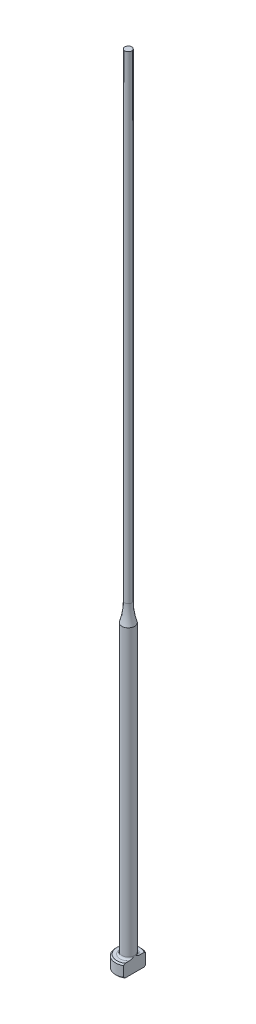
from build123d import *
from build123d.topology import SkipClean

# Parameters (mm, degrees)
CHAMFER1_SIZE = 0.2
FILLET1_R     = 0.3
KEY_DEPTH     = 126.031995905


with BuildPart() as part:
    # Sketch1 → Revolve1 (revolve)
    with BuildSketch(Plane.XY, mode=Mode.PRIVATE) as revolve1_sk:
        with BuildLine():
            Line((0, 0), (-2, 0))
            Line((-2, 0), (-2, 2))
            Line((-2, 2), (-1, 2))
            Line((-1, 2), (-1, 47.03394201))
            ThreePointArc((-1, 47.03394201), (-0.663140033, 48.5), (-0.55, 50))
            Line((-0.55, 50), (-0.55, 125))
            Line((-0.55, 125), (0, 125))
            Line((0, 125), (0, 0))
        make_face()
    revolve(revolve1_sk.sketch.rotate(Axis((0, 259.958771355, 0), (0, -1, 0)), 270), axis=Axis((0, 259.958771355, 0), (0, -1, 0)))

    # Chamfer1
    chamfer1_edges = [part.edges().sort_by_distance(p)[0] for p in [
        (0, 0, -2),
        (0, 2, -2),
    ]]
    chamfer(chamfer1_edges, length=CHAMFER1_SIZE)

    # Fillet1
    fillet1_edges = [part.edges().sort_by_distance(p)[0] for p in [
        (0, 2, -1),
    ]]
    fillet(fillet1_edges, radius=FILLET1_R)

    # Sketch2 → KEY (cut, through all)
    with SkipClean():  # the faces are left unmerged after this step: merging them gives an invalid solid
        with BuildSketch(Plane(origin=(0, 0, 0), x_dir=(1, 0, 0), z_dir=(0, 1, 0))):
            with BuildLine():
                Line((1, 1.732050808), (1, -1.732050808))
                ThreePointArc((1, -1.732050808), (2, 0), (1, 1.732050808))
            make_face()
        extrude(amount=KEY_DEPTH, mode=Mode.SUBTRACT)


solid = part.part
